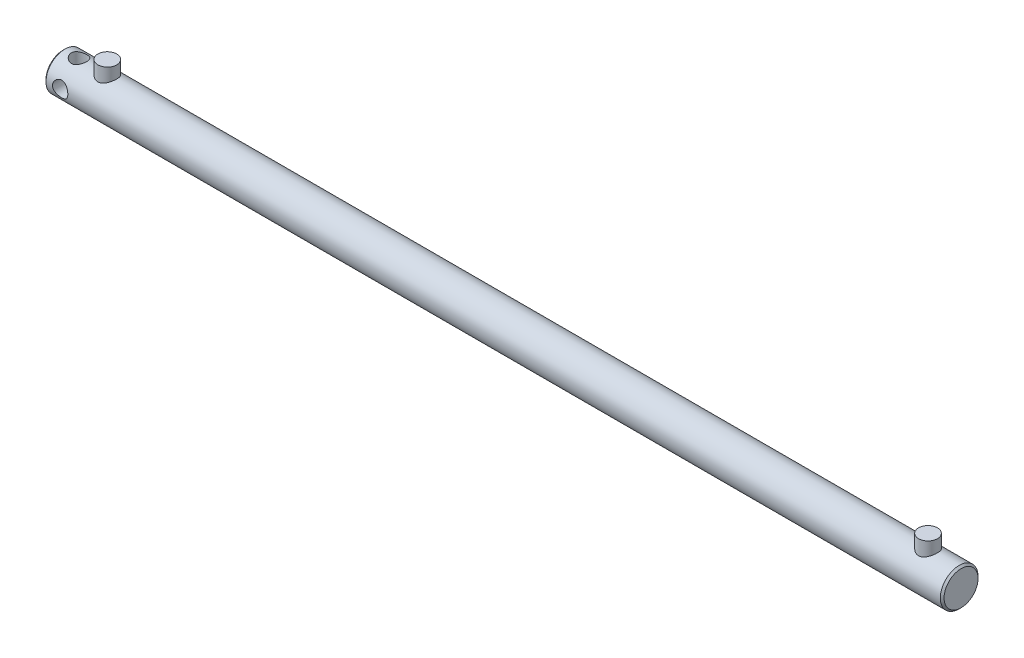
from build123d import *

# Parameters (mm, degrees)
ESQUISSE1_W                         = 952
ESQUISSE1_H                         = 20
CHANFREIN1_SIZE                     = 2
ENL_V_MAT_EXTRU_1_DEPTH             = 477.839595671
ENL_V_MAT_EXTRU_1_DEPTH_BACK        = 477.839595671
ESQUISSE3_R                         = 8.1
ESQUISSE5_R                         = 10
EXTRUSION2_DEPTH                    = 33
ENL_V_MAT_EXTRU_2_REACH             = 479.562
ESQUISSE6_R                         = 8.1
ENL_V_MAT_EXTRU_2_DIRECTION_2_REACH = 479.562


with BuildPart() as part:
    # Esquisse1 → R_volution1 (revolve)
    with BuildSketch(Plane.XY, mode=Mode.PRIVATE) as r_volution1_sk:
        with Locations((0, 10)):
            Rectangle(ESQUISSE1_W, ESQUISSE1_H)
    revolve(r_volution1_sk.sketch.rotate(Axis((-476, 0, 0), (1, 0, 0)), 90), axis=Axis((-476, 0, 0), (1, 0, 0)))

    # Chanfrein1
    chanfrein1_edges = [part.edges().sort_by_distance(p)[0] for p in [
        (476, 0, -20),
        (-476, 0, -20),
    ]]
    chamfer(chanfrein1_edges, length=CHANFREIN1_SIZE)

    # Esquisse3 → Enl_v. mat.-Extru.1 (cut, two sides: drawn at the far end of the back side and taken through both)
    with BuildSketch(Plane.XY.offset(-ENL_V_MAT_EXTRU_1_DEPTH_BACK)):
        with Locations((-459, 0)):
            Circle(ESQUISSE3_R)
    extrude(amount=ENL_V_MAT_EXTRU_1_DEPTH + ENL_V_MAT_EXTRU_1_DEPTH_BACK, mode=Mode.SUBTRACT)

    # Esquisse5 → Extrusion2 (add)
    with BuildSketch(Plane(origin=(0, 0, 0), x_dir=(1, 0, 0), z_dir=(0, 1, 0))):
        with Locations(Location((-429, 0, 0), (0, 0, 90))):
            Circle(ESQUISSE5_R)
        with Locations(Location((441, 0, 0), (0, 0, 90))):
            Circle(ESQUISSE5_R)
    extrude(amount=EXTRUSION2_DEPTH)

    # Esquisse6 → Enl_v. mat.-Extru.2 (cut, up to next)
    with BuildSketch(Plane(origin=(0, 0, 0), x_dir=(1, 0, 0), z_dir=(0, 1, 0)), mode=Mode.PRIVATE) as enl_v_mat_extru_2_sk1:
        with Locations(Location((-459, 0, 0), (0, 0, 90))):
            Circle(ESQUISSE6_R)
    enl_v_mat_extru_2_tool1 = extrude(enl_v_mat_extru_2_sk1.sketch, amount=-ENL_V_MAT_EXTRU_2_REACH, mode=Mode.PRIVATE) & part.part
    add(enl_v_mat_extru_2_tool1.solids().sort_by_distance((-459, 0, 0))[0], mode=Mode.SUBTRACT)

    # Esquisse6 → Enl_v. mat.-Extru.2 direction 2 (cut, up to next)
    with BuildSketch(Plane(origin=(0, 0, 0), x_dir=(1, 0, 0), z_dir=(0, 1, 0)), mode=Mode.PRIVATE) as enl_v_mat_extru_2_direction_2_sk1:
        with Locations(Location((-459, 0, 0), (0, 0, 90))):
            Circle(ESQUISSE6_R)
    enl_v_mat_extru_2_direction_2_tool1 = extrude(enl_v_mat_extru_2_direction_2_sk1.sketch, amount=ENL_V_MAT_EXTRU_2_DIRECTION_2_REACH, mode=Mode.PRIVATE) & part.part
    add(enl_v_mat_extru_2_direction_2_tool1.solids().sort_by_distance((-459, 0, 0))[0], mode=Mode.SUBTRACT)


solid = part.part
